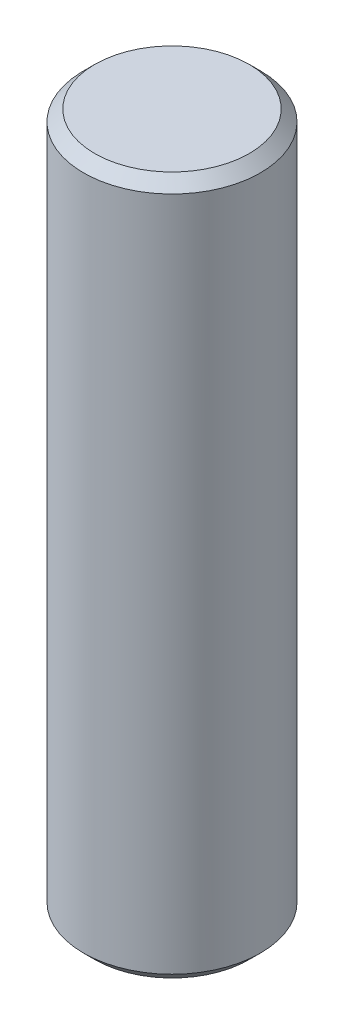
ISO-10303-21;
HEADER;
FILE_DESCRIPTION(('STEP AP214'),'2;1');
FILE_NAME('part.step','',(''),(''),'','','');
FILE_SCHEMA(('AUTOMOTIVE_DESIGN { 1 0 10303 214 1 1 1 1 }'));
ENDSEC;
DATA;
#1=APPLICATION_CONTEXT('core data for automotive mechanical design processes');
#2=APPLICATION_PROTOCOL_DEFINITION('international standard','automotive_design',2000,#1);
#3=PRODUCT_CONTEXT('',#1,'mechanical');
#4=PRODUCT('Part','Part','',(#3));
#5=PRODUCT_RELATED_PRODUCT_CATEGORY('part','',(#4));
#6=PRODUCT_DEFINITION_FORMATION('','',#4);
#7=PRODUCT_DEFINITION_CONTEXT('part definition',#1,'design');
#8=PRODUCT_DEFINITION('design','',#6,#7);
#9=PRODUCT_DEFINITION_SHAPE('','',#8);
#10=(LENGTH_UNIT() NAMED_UNIT(*) SI_UNIT(.MILLI.,.METRE.));
#11=(NAMED_UNIT(*) PLANE_ANGLE_UNIT() SI_UNIT($,.RADIAN.));
#12=(NAMED_UNIT(*) SI_UNIT($,.STERADIAN.) SOLID_ANGLE_UNIT());
#13=UNCERTAINTY_MEASURE_WITH_UNIT(LENGTH_MEASURE(1.E-05),#10,'distance_accuracy_value','');
#14=(GEOMETRIC_REPRESENTATION_CONTEXT(3) GLOBAL_UNCERTAINTY_ASSIGNED_CONTEXT((#13)) GLOBAL_UNIT_ASSIGNED_CONTEXT((#10,
#11,#12)) REPRESENTATION_CONTEXT('',''));
#15=CARTESIAN_POINT('',(0.,0.,0.));
#16=DIRECTION('',(0.,0.,1.));
#17=DIRECTION('',(1.,0.,0.));
#18=AXIS2_PLACEMENT_3D('',#15,#16,#17);
#19=CARTESIAN_POINT('',(0.,19.05,0.));
#20=DIRECTION('',(0.,-1.,0.));
#21=DIRECTION('',(0.,0.,-1.));
#22=AXIS2_PLACEMENT_3D('',#19,#20,#21);
#23=CYLINDRICAL_SURFACE('',#22,2.413);
#24=CARTESIAN_POINT('',(0.,0.304800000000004,0.));
#25=DIRECTION('',(0.,1.,0.));
#26=DIRECTION('',(0.,0.,1.));
#27=AXIS2_PLACEMENT_3D('',#24,#25,#26);
#28=CIRCLE('',#27,2.413);
#29=CARTESIAN_POINT('',(0.,0.304800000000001,-2.413));
#30=VERTEX_POINT('',#29);
#31=EDGE_CURVE('E38',#30,#30,#28,.T.);
#32=CARTESIAN_POINT('',(0.,18.7452,0.));
#33=DIRECTION('',(0.,1.,0.));
#34=DIRECTION('',(0.,0.,1.));
#35=AXIS2_PLACEMENT_3D('',#32,#33,#34);
#36=CIRCLE('',#35,2.413);
#37=CARTESIAN_POINT('',(0.,18.7452,-2.413));
#38=VERTEX_POINT('',#37);
#39=EDGE_CURVE('E42',#38,#38,#36,.F.);
#40=CARTESIAN_POINT('',(0.,0.304800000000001,-2.413));
#41=CARTESIAN_POINT('',(0.,0.496887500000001,-2.413));
#42=CARTESIAN_POINT('',(0.,0.688975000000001,-2.413));
#43=CARTESIAN_POINT('',(0.,1.07315,-2.413));
#44=CARTESIAN_POINT('',(0.,1.2652375,-2.413));
#45=CARTESIAN_POINT('',(0.,1.6494125,-2.413));
#46=CARTESIAN_POINT('',(0.,1.8415,-2.413));
#47=CARTESIAN_POINT('',(0.,2.225675,-2.413));
#48=CARTESIAN_POINT('',(0.,2.4177625,-2.413));
#49=CARTESIAN_POINT('',(0.,2.8019375,-2.413));
#50=CARTESIAN_POINT('',(0.,2.994025,-2.413));
#51=CARTESIAN_POINT('',(0.,3.3782,-2.413));
#52=CARTESIAN_POINT('',(0.,3.5702875,-2.413));
#53=CARTESIAN_POINT('',(0.,3.9544625,-2.413));
#54=CARTESIAN_POINT('',(0.,4.14655,-2.413));
#55=CARTESIAN_POINT('',(0.,4.530725,-2.413));
#56=CARTESIAN_POINT('',(0.,4.7228125,-2.413));
#57=CARTESIAN_POINT('',(0.,5.1069875,-2.413));
#58=CARTESIAN_POINT('',(0.,5.299075,-2.413));
#59=CARTESIAN_POINT('',(0.,5.68325,-2.413));
#60=CARTESIAN_POINT('',(0.,5.8753375,-2.413));
#61=CARTESIAN_POINT('',(0.,6.2595125,-2.413));
#62=CARTESIAN_POINT('',(0.,6.4516,-2.413));
#63=CARTESIAN_POINT('',(0.,6.835775,-2.413));
#64=CARTESIAN_POINT('',(0.,7.0278625,-2.413));
#65=CARTESIAN_POINT('',(0.,7.4120375,-2.413));
#66=CARTESIAN_POINT('',(0.,7.604125,-2.413));
#67=CARTESIAN_POINT('',(0.,7.9883,-2.413));
#68=CARTESIAN_POINT('',(0.,8.1803875,-2.413));
#69=CARTESIAN_POINT('',(0.,8.5645625,-2.413));
#70=CARTESIAN_POINT('',(0.,8.75665,-2.413));
#71=CARTESIAN_POINT('',(0.,9.140825,-2.413));
#72=CARTESIAN_POINT('',(0.,9.3329125,-2.413));
#73=CARTESIAN_POINT('',(0.,9.7170875,-2.413));
#74=CARTESIAN_POINT('',(0.,9.909175,-2.413));
#75=CARTESIAN_POINT('',(0.,10.29335,-2.413));
#76=CARTESIAN_POINT('',(0.,10.4854375,-2.413));
#77=CARTESIAN_POINT('',(0.,10.8696125,-2.413));
#78=CARTESIAN_POINT('',(0.,11.0617,-2.413));
#79=CARTESIAN_POINT('',(0.,11.445875,-2.413));
#80=CARTESIAN_POINT('',(0.,11.6379625,-2.413));
#81=CARTESIAN_POINT('',(0.,12.0221375,-2.413));
#82=CARTESIAN_POINT('',(0.,12.214225,-2.413));
#83=CARTESIAN_POINT('',(0.,12.5984,-2.413));
#84=CARTESIAN_POINT('',(0.,12.7904875,-2.413));
#85=CARTESIAN_POINT('',(0.,13.1746625,-2.413));
#86=CARTESIAN_POINT('',(0.,13.36675,-2.413));
#87=CARTESIAN_POINT('',(0.,13.750925,-2.413));
#88=CARTESIAN_POINT('',(0.,13.9430125,-2.413));
#89=CARTESIAN_POINT('',(0.,14.3271875,-2.413));
#90=CARTESIAN_POINT('',(0.,14.519275,-2.413));
#91=CARTESIAN_POINT('',(0.,14.90345,-2.413));
#92=CARTESIAN_POINT('',(0.,15.0955375,-2.413));
#93=CARTESIAN_POINT('',(0.,15.4797125,-2.413));
#94=CARTESIAN_POINT('',(0.,15.6718,-2.413));
#95=CARTESIAN_POINT('',(0.,16.055975,-2.413));
#96=CARTESIAN_POINT('',(0.,16.2480625,-2.413));
#97=CARTESIAN_POINT('',(0.,16.6322375,-2.413));
#98=CARTESIAN_POINT('',(0.,16.824325,-2.413));
#99=CARTESIAN_POINT('',(0.,17.2085,-2.413));
#100=CARTESIAN_POINT('',(0.,17.4005875,-2.413));
#101=CARTESIAN_POINT('',(0.,17.7847625,-2.413));
#102=CARTESIAN_POINT('',(0.,17.97685,-2.413));
#103=CARTESIAN_POINT('',(0.,18.361025,-2.413));
#104=CARTESIAN_POINT('',(0.,18.5531125,-2.413));
#105=CARTESIAN_POINT('',(0.,18.7452,-2.413));
#106=B_SPLINE_CURVE_WITH_KNOTS('',3,(#40,#41,#42,#43,#44,#45,#46,#47,#48,#49,#50,#51,#52,#53,
#54,#55,#56,#57,#58,#59,#60,#61,#62,#63,#64,#65,#66,#67,#68,#69,#70,#71,#72,#73,#74,#75,#76,#77,
#78,#79,#80,#81,#82,#83,#84,#85,#86,#87,#88,#89,#90,#91,#92,#93,#94,#95,#96,#97,#98,#99,#100,
#101,#102,#103,#104,#105),.UNSPECIFIED.,.F.,.F.,(4,2,2,2,2,2,2,2,2,2,2,2,2,2,2,2,2,2,2,2,2,2,2,
2,2,2,2,2,2,2,2,2,4),(0.,0.576262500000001,1.152525,1.7287875,2.30505,2.8813125,3.457575,
4.0338375,4.6101,5.1863625,5.762625,6.3388875,6.91515,7.4914125,8.067675,8.6439375,9.2202,
9.7964625,10.372725,10.9489875,11.52525,12.1015125,12.677775,13.2540375,13.8303,14.4065625,
14.982825,15.5590875,16.13535,16.7116125,17.287875,17.8641375,18.4404),.UNSPECIFIED.);
#107=EDGE_CURVE('BSEAM28',#30,#38,#106,.T.);
#108=ORIENTED_EDGE('',*,*,#31,.T.);
#109=ORIENTED_EDGE('',*,*,#39,.T.);
#110=ORIENTED_EDGE('',*,*,#107,.T.);
#111=ORIENTED_EDGE('',*,*,#107,.F.);
#112=EDGE_LOOP('',(#108,#110,#109,#111));
#113=FACE_BOUND('',#112,.T.);
#114=ADVANCED_FACE('F28',(#113),#23,.T.);
#115=CARTESIAN_POINT('',(0.,19.05,0.));
#116=DIRECTION('',(0.,1.,0.));
#117=DIRECTION('',(0.,0.,1.));
#118=AXIS2_PLACEMENT_3D('',#115,#116,#117);
#119=PLANE('',#118);
#120=CARTESIAN_POINT('',(0.,19.05,0.));
#121=DIRECTION('',(0.,1.,0.));
#122=DIRECTION('',(0.,0.,1.));
#123=AXIS2_PLACEMENT_3D('',#120,#121,#122);
#124=CIRCLE('',#123,2.1082);
#125=CARTESIAN_POINT('',(0.,19.05,2.1082));
#126=VERTEX_POINT('',#125);
#127=EDGE_CURVE('E10',#126,#126,#124,.T.);
#128=ORIENTED_EDGE('',*,*,#127,.T.);
#129=EDGE_LOOP('',(#128));
#130=FACE_BOUND('',#129,.T.);
#131=ADVANCED_FACE('F61',(#130),#119,.T.);
#132=CARTESIAN_POINT('',(0.,0.,0.));
#133=DIRECTION('',(0.,1.,0.));
#134=DIRECTION('',(0.,0.,1.));
#135=AXIS2_PLACEMENT_3D('',#132,#133,#134);
#136=PLANE('',#135);
#137=CARTESIAN_POINT('',(0.,0.,0.));
#138=DIRECTION('',(0.,1.,0.));
#139=DIRECTION('',(0.,0.,1.));
#140=AXIS2_PLACEMENT_3D('',#137,#138,#139);
#141=CIRCLE('',#140,2.1082);
#142=CARTESIAN_POINT('',(0.,0.,2.1082));
#143=VERTEX_POINT('',#142);
#144=EDGE_CURVE('E34',#143,#143,#141,.F.);
#145=ORIENTED_EDGE('',*,*,#144,.T.);
#146=EDGE_LOOP('',(#145));
#147=FACE_BOUND('',#146,.T.);
#148=ADVANCED_FACE('F57',(#147),#136,.F.);
#149=CARTESIAN_POINT('',(0.,0.304800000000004,0.));
#150=DIRECTION('',(0.,1.,0.));
#151=DIRECTION('',(0.,0.,1.));
#152=AXIS2_PLACEMENT_3D('',#149,#150,#151);
#153=CONICAL_SURFACE('',#152,2.413,0.785398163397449);
#154=ORIENTED_EDGE('',*,*,#144,.F.);
#155=EDGE_LOOP('',(#154));
#156=FACE_BOUND('',#155,.T.);
#157=ORIENTED_EDGE('',*,*,#31,.F.);
#158=EDGE_LOOP('',(#157));
#159=FACE_BOUND('',#158,.T.);
#160=ADVANCED_FACE('F52',(#156,#159),#153,.T.);
#161=CARTESIAN_POINT('',(0.,19.05,0.));
#162=DIRECTION('',(0.,-1.,0.));
#163=DIRECTION('',(0.,0.,-1.));
#164=AXIS2_PLACEMENT_3D('',#161,#162,#163);
#165=CONICAL_SURFACE('',#164,2.1082,0.785398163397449);
#166=ORIENTED_EDGE('',*,*,#39,.F.);
#167=EDGE_LOOP('',(#166));
#168=FACE_BOUND('',#167,.T.);
#169=ORIENTED_EDGE('',*,*,#127,.F.);
#170=EDGE_LOOP('',(#169));
#171=FACE_BOUND('',#170,.T.);
#172=ADVANCED_FACE('F49',(#168,#171),#165,.T.);
#173=CLOSED_SHELL('',(#114,#131,#148,#160,#172));
#174=MANIFOLD_SOLID_BREP('B2',#173);
#175=ADVANCED_BREP_SHAPE_REPRESENTATION('',(#18,#174),#14);
#176=SHAPE_DEFINITION_REPRESENTATION(#9,#175);
ENDSEC;
END-ISO-10303-21;
